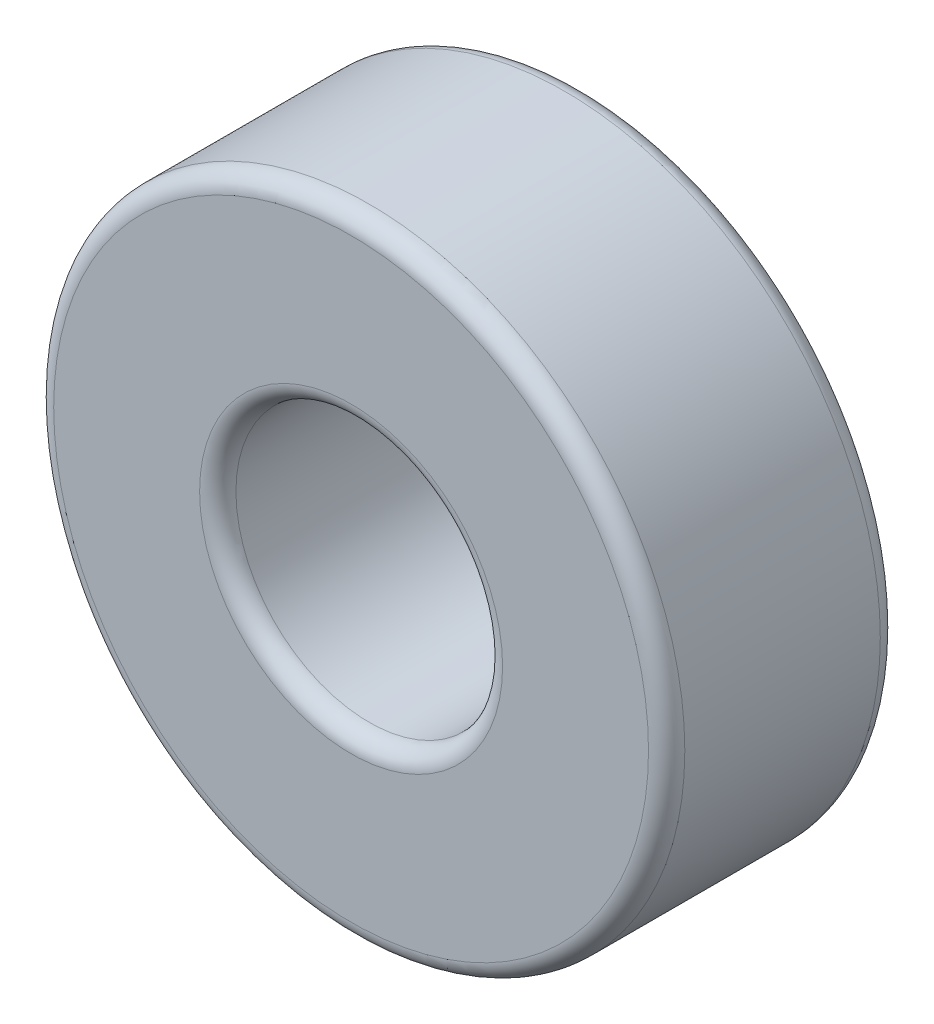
ISO-10303-21;
HEADER;
FILE_DESCRIPTION(('STEP AP214'),'2;1');
FILE_NAME('part.step','',(''),(''),'','','');
FILE_SCHEMA(('AUTOMOTIVE_DESIGN { 1 0 10303 214 1 1 1 1 }'));
ENDSEC;
DATA;
#1=APPLICATION_CONTEXT('core data for automotive mechanical design processes');
#2=APPLICATION_PROTOCOL_DEFINITION('international standard','automotive_design',2000,#1);
#3=PRODUCT_CONTEXT('',#1,'mechanical');
#4=PRODUCT('Part','Part','',(#3));
#5=PRODUCT_RELATED_PRODUCT_CATEGORY('part','',(#4));
#6=PRODUCT_DEFINITION_FORMATION('','',#4);
#7=PRODUCT_DEFINITION_CONTEXT('part definition',#1,'design');
#8=PRODUCT_DEFINITION('design','',#6,#7);
#9=PRODUCT_DEFINITION_SHAPE('','',#8);
#10=(LENGTH_UNIT() NAMED_UNIT(*) SI_UNIT(.MILLI.,.METRE.));
#11=(NAMED_UNIT(*) PLANE_ANGLE_UNIT() SI_UNIT($,.RADIAN.));
#12=(NAMED_UNIT(*) SI_UNIT($,.STERADIAN.) SOLID_ANGLE_UNIT());
#13=UNCERTAINTY_MEASURE_WITH_UNIT(LENGTH_MEASURE(1.E-05),#10,'distance_accuracy_value','');
#14=(GEOMETRIC_REPRESENTATION_CONTEXT(3) GLOBAL_UNCERTAINTY_ASSIGNED_CONTEXT((#13)) GLOBAL_UNIT_ASSIGNED_CONTEXT((#10,
#11,#12)) REPRESENTATION_CONTEXT('',''));
#15=CARTESIAN_POINT('',(0.,0.,0.));
#16=DIRECTION('',(0.,0.,1.));
#17=DIRECTION('',(1.,0.,0.));
#18=AXIS2_PLACEMENT_3D('',#15,#16,#17);
#19=CARTESIAN_POINT('',(0.,0.,8.3));
#20=DIRECTION('',(0.,0.,-1.));
#21=DIRECTION('',(-1.,0.,0.));
#22=AXIS2_PLACEMENT_3D('',#19,#20,#21);
#23=CYLINDRICAL_SURFACE('',#22,9.55);
#24=CARTESIAN_POINT('',(0.,0.,-7.));
#25=DIRECTION('',(0.,0.,1.));
#26=DIRECTION('',(1.,0.,0.));
#27=AXIS2_PLACEMENT_3D('',#24,#25,#26);
#28=CIRCLE('',#27,9.55);
#29=CARTESIAN_POINT('',(-9.55,0.,-7.));
#30=VERTEX_POINT('',#29);
#31=EDGE_CURVE('E65',#30,#30,#28,.F.);
#32=CARTESIAN_POINT('',(0.,0.,7.));
#33=DIRECTION('',(0.,0.,1.));
#34=DIRECTION('',(1.,0.,0.));
#35=AXIS2_PLACEMENT_3D('',#32,#33,#34);
#36=CIRCLE('',#35,9.55);
#37=CARTESIAN_POINT('',(-9.55,0.,7.));
#38=VERTEX_POINT('',#37);
#39=EDGE_CURVE('E69',#38,#38,#36,.T.);
#40=CARTESIAN_POINT('',(-9.55,0.,-7.));
#41=CARTESIAN_POINT('',(-9.55,0.,-6.85416666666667));
#42=CARTESIAN_POINT('',(-9.55,0.,-6.70833333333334));
#43=CARTESIAN_POINT('',(-9.55,0.,-6.41666666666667));
#44=CARTESIAN_POINT('',(-9.55,0.,-6.27083333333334));
#45=CARTESIAN_POINT('',(-9.55,0.,-5.97916666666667));
#46=CARTESIAN_POINT('',(-9.55,0.,-5.83333333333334));
#47=CARTESIAN_POINT('',(-9.55,0.,-5.54166666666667));
#48=CARTESIAN_POINT('',(-9.55,0.,-5.39583333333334));
#49=CARTESIAN_POINT('',(-9.55,0.,-5.10416666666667));
#50=CARTESIAN_POINT('',(-9.55,0.,-4.95833333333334));
#51=CARTESIAN_POINT('',(-9.55,0.,-4.66666666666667));
#52=CARTESIAN_POINT('',(-9.55,0.,-4.52083333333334));
#53=CARTESIAN_POINT('',(-9.55,0.,-4.22916666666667));
#54=CARTESIAN_POINT('',(-9.55,0.,-4.08333333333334));
#55=CARTESIAN_POINT('',(-9.55,0.,-3.79166666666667));
#56=CARTESIAN_POINT('',(-9.55,0.,-3.64583333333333));
#57=CARTESIAN_POINT('',(-9.55,0.,-3.35416666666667));
#58=CARTESIAN_POINT('',(-9.55,0.,-3.20833333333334));
#59=CARTESIAN_POINT('',(-9.55,0.,-2.91666666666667));
#60=CARTESIAN_POINT('',(-9.55,0.,-2.77083333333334));
#61=CARTESIAN_POINT('',(-9.55,0.,-2.47916666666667));
#62=CARTESIAN_POINT('',(-9.55,0.,-2.33333333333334));
#63=CARTESIAN_POINT('',(-9.55,0.,-2.04166666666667));
#64=CARTESIAN_POINT('',(-9.55,0.,-1.89583333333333));
#65=CARTESIAN_POINT('',(-9.55,0.,-1.60416666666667));
#66=CARTESIAN_POINT('',(-9.55,0.,-1.45833333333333));
#67=CARTESIAN_POINT('',(-9.55,0.,-1.16666666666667));
#68=CARTESIAN_POINT('',(-9.55,0.,-1.02083333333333));
#69=CARTESIAN_POINT('',(-9.55,0.,-0.729166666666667));
#70=CARTESIAN_POINT('',(-9.55,0.,-0.583333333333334));
#71=CARTESIAN_POINT('',(-9.55,0.,-0.291666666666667));
#72=CARTESIAN_POINT('',(-9.55,0.,-0.145833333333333));
#73=CARTESIAN_POINT('',(-9.55,0.,0.145833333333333));
#74=CARTESIAN_POINT('',(-9.55,0.,0.291666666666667));
#75=CARTESIAN_POINT('',(-9.55,0.,0.583333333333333));
#76=CARTESIAN_POINT('',(-9.55,0.,0.729166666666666));
#77=CARTESIAN_POINT('',(-9.55,0.,1.02083333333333));
#78=CARTESIAN_POINT('',(-9.55,0.,1.16666666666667));
#79=CARTESIAN_POINT('',(-9.55,0.,1.45833333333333));
#80=CARTESIAN_POINT('',(-9.55,0.,1.60416666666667));
#81=CARTESIAN_POINT('',(-9.55,0.,1.89583333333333));
#82=CARTESIAN_POINT('',(-9.55,0.,2.04166666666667));
#83=CARTESIAN_POINT('',(-9.55,0.,2.33333333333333));
#84=CARTESIAN_POINT('',(-9.55,0.,2.47916666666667));
#85=CARTESIAN_POINT('',(-9.55,0.,2.77083333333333));
#86=CARTESIAN_POINT('',(-9.55,0.,2.91666666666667));
#87=CARTESIAN_POINT('',(-9.55,0.,3.20833333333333));
#88=CARTESIAN_POINT('',(-9.55,0.,3.35416666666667));
#89=CARTESIAN_POINT('',(-9.55,0.,3.64583333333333));
#90=CARTESIAN_POINT('',(-9.55,0.,3.79166666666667));
#91=CARTESIAN_POINT('',(-9.55,0.,4.08333333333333));
#92=CARTESIAN_POINT('',(-9.55,0.,4.22916666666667));
#93=CARTESIAN_POINT('',(-9.55,0.,4.52083333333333));
#94=CARTESIAN_POINT('',(-9.55,0.,4.66666666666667));
#95=CARTESIAN_POINT('',(-9.55,0.,4.95833333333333));
#96=CARTESIAN_POINT('',(-9.55,0.,5.10416666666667));
#97=CARTESIAN_POINT('',(-9.55,0.,5.39583333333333));
#98=CARTESIAN_POINT('',(-9.55,0.,5.54166666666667));
#99=CARTESIAN_POINT('',(-9.55,0.,5.83333333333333));
#100=CARTESIAN_POINT('',(-9.55,0.,5.97916666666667));
#101=CARTESIAN_POINT('',(-9.55,0.,6.27083333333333));
#102=CARTESIAN_POINT('',(-9.55,0.,6.41666666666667));
#103=CARTESIAN_POINT('',(-9.55,0.,6.70833333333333));
#104=CARTESIAN_POINT('',(-9.55,0.,6.85416666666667));
#105=CARTESIAN_POINT('',(-9.55,0.,7.));
#106=B_SPLINE_CURVE_WITH_KNOTS('',3,(#40,#41,#42,#43,#44,#45,#46,#47,#48,#49,#50,#51,#52,#53,
#54,#55,#56,#57,#58,#59,#60,#61,#62,#63,#64,#65,#66,#67,#68,#69,#70,#71,#72,#73,#74,#75,#76,#77,
#78,#79,#80,#81,#82,#83,#84,#85,#86,#87,#88,#89,#90,#91,#92,#93,#94,#95,#96,#97,#98,#99,#100,
#101,#102,#103,#104,#105),.UNSPECIFIED.,.F.,.F.,(4,2,2,2,2,2,2,2,2,2,2,2,2,2,2,2,2,2,2,2,2,2,2,
2,2,2,2,2,2,2,2,2,4),(0.,0.4375,0.875000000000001,1.3125,1.75,2.1875,2.625,3.0625,3.5,3.9375,
4.375,4.8125,5.25,5.6875,6.125,6.5625,7.,7.4375,7.875,8.3125,8.75,9.1875,9.625,10.0625,10.5,
10.9375,11.375,11.8125,12.25,12.6875,13.125,13.5625,14.),.UNSPECIFIED.);
#107=EDGE_CURVE('BSEAM41',#30,#38,#106,.T.);
#108=ORIENTED_EDGE('',*,*,#31,.T.);
#109=ORIENTED_EDGE('',*,*,#39,.T.);
#110=ORIENTED_EDGE('',*,*,#107,.T.);
#111=ORIENTED_EDGE('',*,*,#107,.F.);
#112=EDGE_LOOP('',(#108,#110,#109,#111));
#113=FACE_BOUND('',#112,.T.);
#114=ADVANCED_FACE('F41',(#113),#23,.F.);
#115=CARTESIAN_POINT('',(0.,0.,8.3));
#116=DIRECTION('',(0.,0.,-1.));
#117=DIRECTION('',(-1.,0.,0.));
#118=AXIS2_PLACEMENT_3D('',#115,#116,#117);
#119=CYLINDRICAL_SURFACE('',#118,22.6);
#120=CARTESIAN_POINT('',(0.,0.,7.));
#121=DIRECTION('',(0.,0.,1.));
#122=DIRECTION('',(1.,0.,0.));
#123=AXIS2_PLACEMENT_3D('',#120,#121,#122);
#124=CIRCLE('',#123,22.6);
#125=CARTESIAN_POINT('',(-22.6,0.,7.));
#126=VERTEX_POINT('',#125);
#127=EDGE_CURVE('E10',#126,#126,#124,.F.);
#128=CARTESIAN_POINT('',(0.,0.,-7.));
#129=DIRECTION('',(0.,0.,1.));
#130=DIRECTION('',(1.,0.,0.));
#131=AXIS2_PLACEMENT_3D('',#128,#129,#130);
#132=CIRCLE('',#131,22.6);
#133=CARTESIAN_POINT('',(-22.6,0.,-7.));
#134=VERTEX_POINT('',#133);
#135=EDGE_CURVE('E49',#134,#134,#132,.T.);
#136=CARTESIAN_POINT('',(-22.6,0.,7.));
#137=CARTESIAN_POINT('',(-22.6,0.,6.85416666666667));
#138=CARTESIAN_POINT('',(-22.6,0.,6.70833333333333));
#139=CARTESIAN_POINT('',(-22.6,0.,6.41666666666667));
#140=CARTESIAN_POINT('',(-22.6,0.,6.27083333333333));
#141=CARTESIAN_POINT('',(-22.6,0.,5.97916666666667));
#142=CARTESIAN_POINT('',(-22.6,0.,5.83333333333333));
#143=CARTESIAN_POINT('',(-22.6,0.,5.54166666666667));
#144=CARTESIAN_POINT('',(-22.6,0.,5.39583333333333));
#145=CARTESIAN_POINT('',(-22.6,0.,5.10416666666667));
#146=CARTESIAN_POINT('',(-22.6,0.,4.95833333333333));
#147=CARTESIAN_POINT('',(-22.6,0.,4.66666666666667));
#148=CARTESIAN_POINT('',(-22.6,0.,4.52083333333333));
#149=CARTESIAN_POINT('',(-22.6,0.,4.22916666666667));
#150=CARTESIAN_POINT('',(-22.6,0.,4.08333333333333));
#151=CARTESIAN_POINT('',(-22.6,0.,3.79166666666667));
#152=CARTESIAN_POINT('',(-22.6,0.,3.64583333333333));
#153=CARTESIAN_POINT('',(-22.6,0.,3.35416666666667));
#154=CARTESIAN_POINT('',(-22.6,0.,3.20833333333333));
#155=CARTESIAN_POINT('',(-22.6,0.,2.91666666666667));
#156=CARTESIAN_POINT('',(-22.6,0.,2.77083333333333));
#157=CARTESIAN_POINT('',(-22.6,0.,2.47916666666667));
#158=CARTESIAN_POINT('',(-22.6,0.,2.33333333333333));
#159=CARTESIAN_POINT('',(-22.6,0.,2.04166666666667));
#160=CARTESIAN_POINT('',(-22.6,0.,1.89583333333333));
#161=CARTESIAN_POINT('',(-22.6,0.,1.60416666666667));
#162=CARTESIAN_POINT('',(-22.6,0.,1.45833333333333));
#163=CARTESIAN_POINT('',(-22.6,0.,1.16666666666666));
#164=CARTESIAN_POINT('',(-22.6,0.,1.02083333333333));
#165=CARTESIAN_POINT('',(-22.6,0.,0.729166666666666));
#166=CARTESIAN_POINT('',(-22.6,0.,0.583333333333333));
#167=CARTESIAN_POINT('',(-22.6,0.,0.291666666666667));
#168=CARTESIAN_POINT('',(-22.6,0.,0.145833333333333));
#169=CARTESIAN_POINT('',(-22.6,0.,-0.145833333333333));
#170=CARTESIAN_POINT('',(-22.6,0.,-0.291666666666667));
#171=CARTESIAN_POINT('',(-22.6,0.,-0.583333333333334));
#172=CARTESIAN_POINT('',(-22.6,0.,-0.729166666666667));
#173=CARTESIAN_POINT('',(-22.6,0.,-1.02083333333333));
#174=CARTESIAN_POINT('',(-22.6,0.,-1.16666666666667));
#175=CARTESIAN_POINT('',(-22.6,0.,-1.45833333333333));
#176=CARTESIAN_POINT('',(-22.6,0.,-1.60416666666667));
#177=CARTESIAN_POINT('',(-22.6,0.,-1.89583333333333));
#178=CARTESIAN_POINT('',(-22.6,0.,-2.04166666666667));
#179=CARTESIAN_POINT('',(-22.6,0.,-2.33333333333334));
#180=CARTESIAN_POINT('',(-22.6,0.,-2.47916666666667));
#181=CARTESIAN_POINT('',(-22.6,0.,-2.77083333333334));
#182=CARTESIAN_POINT('',(-22.6,0.,-2.91666666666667));
#183=CARTESIAN_POINT('',(-22.6,0.,-3.20833333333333));
#184=CARTESIAN_POINT('',(-22.6,0.,-3.35416666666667));
#185=CARTESIAN_POINT('',(-22.6,0.,-3.64583333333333));
#186=CARTESIAN_POINT('',(-22.6,0.,-3.79166666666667));
#187=CARTESIAN_POINT('',(-22.6,0.,-4.08333333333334));
#188=CARTESIAN_POINT('',(-22.6,0.,-4.22916666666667));
#189=CARTESIAN_POINT('',(-22.6,0.,-4.52083333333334));
#190=CARTESIAN_POINT('',(-22.6,0.,-4.66666666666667));
#191=CARTESIAN_POINT('',(-22.6,0.,-4.95833333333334));
#192=CARTESIAN_POINT('',(-22.6,0.,-5.10416666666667));
#193=CARTESIAN_POINT('',(-22.6,0.,-5.39583333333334));
#194=CARTESIAN_POINT('',(-22.6,0.,-5.54166666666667));
#195=CARTESIAN_POINT('',(-22.6,0.,-5.83333333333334));
#196=CARTESIAN_POINT('',(-22.6,0.,-5.97916666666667));
#197=CARTESIAN_POINT('',(-22.6,0.,-6.27083333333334));
#198=CARTESIAN_POINT('',(-22.6,0.,-6.41666666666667));
#199=CARTESIAN_POINT('',(-22.6,0.,-6.70833333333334));
#200=CARTESIAN_POINT('',(-22.6,0.,-6.85416666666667));
#201=CARTESIAN_POINT('',(-22.6,0.,-7.));
#202=B_SPLINE_CURVE_WITH_KNOTS('',3,(#136,#137,#138,#139,#140,#141,#142,#143,#144,#145,#146,
#147,#148,#149,#150,#151,#152,#153,#154,#155,#156,#157,#158,#159,#160,#161,#162,#163,#164,#165,
#166,#167,#168,#169,#170,#171,#172,#173,#174,#175,#176,#177,#178,#179,#180,#181,#182,#183,#184,
#185,#186,#187,#188,#189,#190,#191,#192,#193,#194,#195,#196,#197,#198,#199,#200,#201),
.UNSPECIFIED.,.F.,.F.,(4,2,2,2,2,2,2,2,2,2,2,2,2,2,2,2,2,2,2,2,2,2,2,2,2,2,2,2,2,2,2,2,4),(0.,
0.4375,0.875,1.3125,1.75,2.1875,2.625,3.0625,3.5,3.9375,4.375,4.8125,5.25,5.6875,6.125,6.5625,
7.,7.4375,7.875,8.3125,8.75,9.1875,9.625,10.0625,10.5,10.9375,11.375,11.8125,12.25,12.6875,
13.125,13.5625,14.),.UNSPECIFIED.);
#203=EDGE_CURVE('BSEAM93',#126,#134,#202,.T.);
#204=ORIENTED_EDGE('',*,*,#127,.T.);
#205=ORIENTED_EDGE('',*,*,#135,.T.);
#206=ORIENTED_EDGE('',*,*,#203,.T.);
#207=ORIENTED_EDGE('',*,*,#203,.F.);
#208=EDGE_LOOP('',(#204,#206,#205,#207));
#209=FACE_BOUND('',#208,.T.);
#210=ADVANCED_FACE('F93',(#209),#119,.T.);
#211=CARTESIAN_POINT('',(0.,0.,8.3));
#212=DIRECTION('',(0.,0.,1.));
#213=DIRECTION('',(1.,0.,0.));
#214=AXIS2_PLACEMENT_3D('',#211,#212,#213);
#215=PLANE('',#214);
#216=CARTESIAN_POINT('',(0.,0.,8.3));
#217=DIRECTION('',(0.,0.,1.));
#218=DIRECTION('',(1.,0.,0.));
#219=AXIS2_PLACEMENT_3D('',#216,#217,#218);
#220=CIRCLE('',#219,10.85);
#221=CARTESIAN_POINT('',(10.85,0.,8.3));
#222=VERTEX_POINT('',#221);
#223=EDGE_CURVE('E54',#222,#222,#220,.F.);
#224=ORIENTED_EDGE('',*,*,#223,.T.);
#225=EDGE_LOOP('',(#224));
#226=FACE_BOUND('',#225,.T.);
#227=CARTESIAN_POINT('',(0.,0.,8.3));
#228=DIRECTION('',(0.,0.,1.));
#229=DIRECTION('',(1.,0.,0.));
#230=AXIS2_PLACEMENT_3D('',#227,#228,#229);
#231=CIRCLE('',#230,21.3);
#232=CARTESIAN_POINT('',(21.3,0.,8.3));
#233=VERTEX_POINT('',#232);
#234=EDGE_CURVE('E59',#233,#233,#231,.T.);
#235=ORIENTED_EDGE('',*,*,#234,.T.);
#236=EDGE_LOOP('',(#235));
#237=FACE_BOUND('',#236,.T.);
#238=ADVANCED_FACE('F99',(#226,#237),#215,.T.);
#239=CARTESIAN_POINT('',(0.,0.,-8.3));
#240=DIRECTION('',(0.,0.,1.));
#241=DIRECTION('',(1.,0.,0.));
#242=AXIS2_PLACEMENT_3D('',#239,#240,#241);
#243=PLANE('',#242);
#244=CARTESIAN_POINT('',(0.,0.,-8.3));
#245=DIRECTION('',(0.,0.,1.));
#246=DIRECTION('',(1.,0.,0.));
#247=AXIS2_PLACEMENT_3D('',#244,#245,#246);
#248=CIRCLE('',#247,10.85);
#249=CARTESIAN_POINT('',(10.85,0.,-8.3));
#250=VERTEX_POINT('',#249);
#251=EDGE_CURVE('E73',#250,#250,#248,.T.);
#252=ORIENTED_EDGE('',*,*,#251,.T.);
#253=EDGE_LOOP('',(#252));
#254=FACE_BOUND('',#253,.T.);
#255=CARTESIAN_POINT('',(0.,0.,-8.3));
#256=DIRECTION('',(0.,0.,1.));
#257=DIRECTION('',(1.,0.,0.));
#258=AXIS2_PLACEMENT_3D('',#255,#256,#257);
#259=CIRCLE('',#258,21.3);
#260=CARTESIAN_POINT('',(21.3,0.,-8.3));
#261=VERTEX_POINT('',#260);
#262=EDGE_CURVE('E77',#261,#261,#259,.F.);
#263=ORIENTED_EDGE('',*,*,#262,.T.);
#264=EDGE_LOOP('',(#263));
#265=FACE_BOUND('',#264,.T.);
#266=ADVANCED_FACE('F82',(#254,#265),#243,.F.);
#267=CARTESIAN_POINT('',(0.,0.,-7.));
#268=DIRECTION('',(0.,0.,1.));
#269=DIRECTION('',(1.,0.,0.));
#270=AXIS2_PLACEMENT_3D('',#267,#268,#269);
#271=TOROIDAL_SURFACE('',#270,10.85,1.3);
#272=ORIENTED_EDGE('',*,*,#31,.F.);
#273=EDGE_LOOP('',(#272));
#274=FACE_BOUND('',#273,.T.);
#275=ORIENTED_EDGE('',*,*,#251,.F.);
#276=EDGE_LOOP('',(#275));
#277=FACE_BOUND('',#276,.T.);
#278=ADVANCED_FACE('F104',(#274,#277),#271,.T.);
#279=CARTESIAN_POINT('',(0.,0.,7.));
#280=DIRECTION('',(0.,0.,1.));
#281=DIRECTION('',(1.,0.,0.));
#282=AXIS2_PLACEMENT_3D('',#279,#280,#281);
#283=TOROIDAL_SURFACE('',#282,10.85,1.3);
#284=ORIENTED_EDGE('',*,*,#223,.F.);
#285=EDGE_LOOP('',(#284));
#286=FACE_BOUND('',#285,.T.);
#287=ORIENTED_EDGE('',*,*,#39,.F.);
#288=EDGE_LOOP('',(#287));
#289=FACE_BOUND('',#288,.T.);
#290=ADVANCED_FACE('F90',(#286,#289),#283,.T.);
#291=CARTESIAN_POINT('',(0.,0.,7.));
#292=DIRECTION('',(0.,0.,1.));
#293=DIRECTION('',(1.,0.,0.));
#294=AXIS2_PLACEMENT_3D('',#291,#292,#293);
#295=TOROIDAL_SURFACE('',#294,21.3,1.3);
#296=ORIENTED_EDGE('',*,*,#127,.F.);
#297=EDGE_LOOP('',(#296));
#298=FACE_BOUND('',#297,.T.);
#299=ORIENTED_EDGE('',*,*,#234,.F.);
#300=EDGE_LOOP('',(#299));
#301=FACE_BOUND('',#300,.T.);
#302=ADVANCED_FACE('F86',(#298,#301),#295,.T.);
#303=CARTESIAN_POINT('',(0.,0.,-7.));
#304=DIRECTION('',(0.,0.,1.));
#305=DIRECTION('',(1.,0.,0.));
#306=AXIS2_PLACEMENT_3D('',#303,#304,#305);
#307=TOROIDAL_SURFACE('',#306,21.3,1.3);
#308=ORIENTED_EDGE('',*,*,#262,.F.);
#309=EDGE_LOOP('',(#308));
#310=FACE_BOUND('',#309,.T.);
#311=ORIENTED_EDGE('',*,*,#135,.F.);
#312=EDGE_LOOP('',(#311));
#313=FACE_BOUND('',#312,.T.);
#314=ADVANCED_FACE('F43',(#310,#313),#307,.T.);
#315=CLOSED_SHELL('',(#114,#210,#238,#266,#278,#290,#302,#314));
#316=MANIFOLD_SOLID_BREP('B2',#315);
#317=ADVANCED_BREP_SHAPE_REPRESENTATION('',(#18,#316),#14);
#318=SHAPE_DEFINITION_REPRESENTATION(#9,#317);
ENDSEC;
END-ISO-10303-21;
